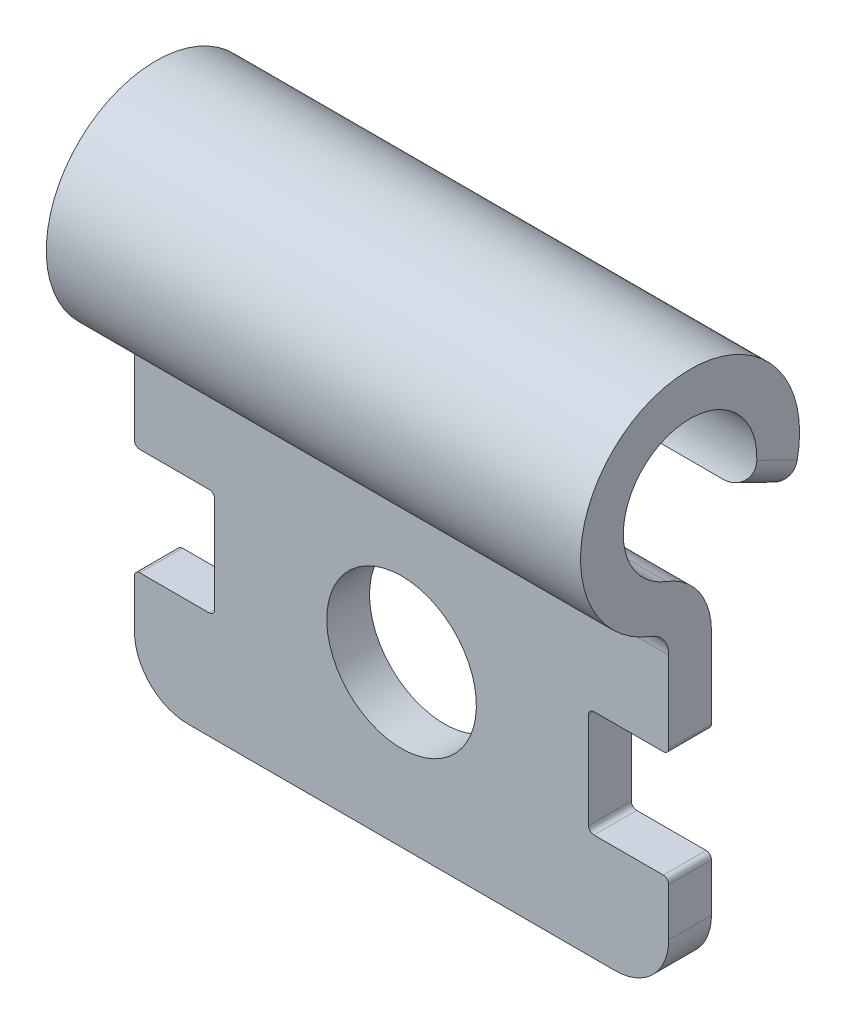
ISO-10303-21;
HEADER;
FILE_DESCRIPTION(('STEP AP214'),'2;1');
FILE_NAME('part.step','',(''),(''),'','','');
FILE_SCHEMA(('AUTOMOTIVE_DESIGN { 1 0 10303 214 1 1 1 1 }'));
ENDSEC;
DATA;
#1=APPLICATION_CONTEXT('core data for automotive mechanical design processes');
#2=APPLICATION_PROTOCOL_DEFINITION('international standard','automotive_design',2000,#1);
#3=PRODUCT_CONTEXT('',#1,'mechanical');
#4=PRODUCT('Part','Part','',(#3));
#5=PRODUCT_RELATED_PRODUCT_CATEGORY('part','',(#4));
#6=PRODUCT_DEFINITION_FORMATION('','',#4);
#7=PRODUCT_DEFINITION_CONTEXT('part definition',#1,'design');
#8=PRODUCT_DEFINITION('design','',#6,#7);
#9=PRODUCT_DEFINITION_SHAPE('','',#8);
#10=(LENGTH_UNIT() NAMED_UNIT(*) SI_UNIT(.MILLI.,.METRE.));
#11=(NAMED_UNIT(*) PLANE_ANGLE_UNIT() SI_UNIT($,.RADIAN.));
#12=(NAMED_UNIT(*) SI_UNIT($,.STERADIAN.) SOLID_ANGLE_UNIT());
#13=UNCERTAINTY_MEASURE_WITH_UNIT(LENGTH_MEASURE(1.E-05),#10,'distance_accuracy_value','');
#14=(GEOMETRIC_REPRESENTATION_CONTEXT(3) GLOBAL_UNCERTAINTY_ASSIGNED_CONTEXT((#13)) GLOBAL_UNIT_ASSIGNED_CONTEXT((#10,
#11,#12)) REPRESENTATION_CONTEXT('',''));
#15=CARTESIAN_POINT('',(0.,0.,0.));
#16=DIRECTION('',(0.,0.,1.));
#17=DIRECTION('',(1.,0.,0.));
#18=AXIS2_PLACEMENT_3D('',#15,#16,#17);
#19=CARTESIAN_POINT('',(10.,-2.38589605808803,0.9));
#20=DIRECTION('',(1.,0.,0.));
#21=DIRECTION('',(0.,0.,-1.));
#22=AXIS2_PLACEMENT_3D('',#19,#20,#21);
#23=PLANE('',#22);
#24=DIRECTION('',(0.,-1.,0.));
#25=VECTOR('',#24,1.);
#26=CARTESIAN_POINT('',(10.,-2.38589605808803,-0.4));
#27=LINE('',#26,#25);
#28=CARTESIAN_POINT('',(10.,-6.1,-0.400000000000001));
#29=VERTEX_POINT('',#28);
#30=CARTESIAN_POINT('',(10.,-7.,-0.400000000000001));
#31=VERTEX_POINT('',#30);
#32=EDGE_CURVE('E242',#29,#31,#27,.T.);
#33=ORIENTED_EDGE('',*,*,#32,.F.);
#34=DIRECTION('',(0.,0.,-1.));
#35=VECTOR('',#34,1.);
#36=CARTESIAN_POINT('',(10.,-6.1,0.4));
#37=LINE('',#36,#35);
#38=CARTESIAN_POINT('',(10.,-6.1,0.399999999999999));
#39=VERTEX_POINT('',#38);
#40=EDGE_CURVE('E456',#29,#39,#37,.F.);
#41=ORIENTED_EDGE('',*,*,#40,.T.);
#42=DIRECTION('',(0.,-1.,0.));
#43=VECTOR('',#42,1.);
#44=CARTESIAN_POINT('',(10.,-2.38589605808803,0.4));
#45=LINE('',#44,#43);
#46=CARTESIAN_POINT('',(10.,-7.,0.399999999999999));
#47=VERTEX_POINT('',#46);
#48=EDGE_CURVE('E271',#39,#47,#45,.T.);
#49=ORIENTED_EDGE('',*,*,#48,.T.);
#50=DIRECTION('',(0.,0.,1.));
#51=VECTOR('',#50,1.);
#52=CARTESIAN_POINT('',(10.,-7.,0.9));
#53=LINE('',#52,#51);
#54=EDGE_CURVE('E531',#47,#31,#53,.F.);
#55=ORIENTED_EDGE('',*,*,#54,.T.);
#56=EDGE_LOOP('',(#33,#41,#49,#55));
#57=FACE_BOUND('',#56,.T.);
#58=ADVANCED_FACE('F34',(#57),#23,.T.);
#59=CARTESIAN_POINT('',(0.,-2.38589605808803,0.9));
#60=DIRECTION('',(1.,0.,0.));
#61=DIRECTION('',(0.,0.,-1.));
#62=AXIS2_PLACEMENT_3D('',#59,#60,#61);
#63=PLANE('',#62);
#64=DIRECTION('',(0.,-1.,0.));
#65=VECTOR('',#64,1.);
#66=CARTESIAN_POINT('',(0.,-2.38589605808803,-0.4));
#67=LINE('',#66,#65);
#68=CARTESIAN_POINT('',(0.,-2.38589605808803,-0.4));
#69=VERTEX_POINT('',#68);
#70=CARTESIAN_POINT('',(0.,-3.9,-0.4));
#71=VERTEX_POINT('',#70);
#72=EDGE_CURVE('E226',#69,#71,#67,.T.);
#73=ORIENTED_EDGE('',*,*,#72,.T.);
#74=DIRECTION('',(0.,0.,1.));
#75=VECTOR('',#74,1.);
#76=CARTESIAN_POINT('',(0.,-3.9,0.9));
#77=LINE('',#76,#75);
#78=CARTESIAN_POINT('',(0.,-3.9,0.4));
#79=VERTEX_POINT('',#78);
#80=EDGE_CURVE('E388',#71,#79,#77,.T.);
#81=ORIENTED_EDGE('',*,*,#80,.T.);
#82=DIRECTION('',(0.,-1.,0.));
#83=VECTOR('',#82,1.);
#84=CARTESIAN_POINT('',(0.,-2.38589605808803,0.4));
#85=LINE('',#84,#83);
#86=CARTESIAN_POINT('',(0.,-2.38589605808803,0.4));
#87=VERTEX_POINT('',#86);
#88=EDGE_CURVE('E257',#87,#79,#85,.T.);
#89=ORIENTED_EDGE('',*,*,#88,.F.);
#90=CARTESIAN_POINT('',(0.,-2.38589605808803,0.9));
#91=DIRECTION('',(-1.,0.,0.));
#92=DIRECTION('',(0.,0.,-1.));
#93=AXIS2_PLACEMENT_3D('',#90,#91,#92);
#94=CIRCLE('',#93,0.5);
#95=CARTESIAN_POINT('',(0.,-1.91807330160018,0.723529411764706));
#96=VERTEX_POINT('',#95);
#97=EDGE_CURVE('E269',#96,#87,#94,.T.);
#98=ORIENTED_EDGE('',*,*,#97,.F.);
#99=CARTESIAN_POINT('',(0.,0.,0.));
#100=DIRECTION('',(1.,0.,0.));
#101=DIRECTION('',(0.,0.,-1.));
#102=AXIS2_PLACEMENT_3D('',#99,#100,#101);
#103=CIRCLE('',#102,2.05);
#104=CARTESIAN_POINT('',(0.,-0.422055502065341,-2.00608303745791));
#105=VERTEX_POINT('',#104);
#106=EDGE_CURVE('E267',#105,#96,#103,.T.);
#107=ORIENTED_EDGE('',*,*,#106,.F.);
#108=DIRECTION('',(0.,0.43834042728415,0.898809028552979));
#109=VECTOR('',#108,1.);
#110=CARTESIAN_POINT('',(0.,-0.098521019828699,-1.3426814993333));
#111=LINE('',#110,#109);
#112=CARTESIAN_POINT('',(0.,-0.0527775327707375,-1.24888531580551));
#113=VERTEX_POINT('',#112);
#114=EDGE_CURVE('E295',#105,#113,#111,.T.);
#115=ORIENTED_EDGE('',*,*,#114,.T.);
#116=CARTESIAN_POINT('',(0.,0.,0.));
#117=DIRECTION('',(1.,0.,0.));
#118=DIRECTION('',(0.,0.,-1.));
#119=AXIS2_PLACEMENT_3D('',#116,#117,#118);
#120=CIRCLE('',#119,1.25);
#121=CARTESIAN_POINT('',(0.,-1.16955689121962,0.441176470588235));
#122=VERTEX_POINT('',#121);
#123=EDGE_CURVE('E265',#113,#122,#120,.T.);
#124=ORIENTED_EDGE('',*,*,#123,.T.);
#125=CARTESIAN_POINT('',(0.,-2.38589605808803,0.9));
#126=DIRECTION('',(1.,0.,0.));
#127=DIRECTION('',(0.,0.,-1.));
#128=AXIS2_PLACEMENT_3D('',#125,#126,#127);
#129=CIRCLE('',#128,1.3);
#130=EDGE_CURVE('E263',#122,#69,#129,.F.);
#131=ORIENTED_EDGE('',*,*,#130,.T.);
#132=EDGE_LOOP('',(#73,#81,#89,#98,#107,#115,#124,#131));
#133=FACE_BOUND('',#132,.T.);
#134=ADVANCED_FACE('F356',(#133),#63,.F.);
#135=CARTESIAN_POINT('',(10.,-2.38589605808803,0.4));
#136=DIRECTION('',(0.,0.,-1.));
#137=DIRECTION('',(0.,1.,0.));
#138=AXIS2_PLACEMENT_3D('',#135,#136,#137);
#139=PLANE('',#138);
#140=CARTESIAN_POINT('',(5.,-5.,0.4));
#141=DIRECTION('',(0.,0.,-1.));
#142=DIRECTION('',(0.,1.,0.));
#143=AXIS2_PLACEMENT_3D('',#140,#141,#142);
#144=CIRCLE('',#143,1.4);
#145=CARTESIAN_POINT('',(5.,-3.6,0.4));
#146=VERTEX_POINT('',#145);
#147=EDGE_CURVE('E568',#146,#146,#144,.T.);
#148=ORIENTED_EDGE('',*,*,#147,.T.);
#149=EDGE_LOOP('',(#148));
#150=FACE_BOUND('',#149,.T.);
#151=ORIENTED_EDGE('',*,*,#48,.F.);
#152=CARTESIAN_POINT('',(9.9,-6.1,0.399999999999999));
#153=DIRECTION('',(0.,0.,-1.));
#154=DIRECTION('',(0.,1.,0.));
#155=AXIS2_PLACEMENT_3D('',#152,#153,#154);
#156=CIRCLE('',#155,0.1);
#157=CARTESIAN_POINT('',(9.9,-6.,0.4));
#158=VERTEX_POINT('',#157);
#159=EDGE_CURVE('E463',#39,#158,#156,.F.);
#160=ORIENTED_EDGE('',*,*,#159,.T.);
#161=DIRECTION('',(1.,0.,0.));
#162=VECTOR('',#161,1.);
#163=CARTESIAN_POINT('',(10.,-6.,0.4));
#164=LINE('',#163,#162);
#165=CARTESIAN_POINT('',(8.6,-6.,0.4));
#166=VERTEX_POINT('',#165);
#167=EDGE_CURVE('E546',#166,#158,#164,.T.);
#168=ORIENTED_EDGE('',*,*,#167,.F.);
#169=CARTESIAN_POINT('',(8.6,-5.9,0.399999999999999));
#170=DIRECTION('',(0.,0.,-1.));
#171=DIRECTION('',(0.,1.,0.));
#172=AXIS2_PLACEMENT_3D('',#169,#170,#171);
#173=CIRCLE('',#172,0.1);
#174=CARTESIAN_POINT('',(8.5,-5.9,0.4));
#175=VERTEX_POINT('',#174);
#176=EDGE_CURVE('E391',#166,#175,#173,.T.);
#177=ORIENTED_EDGE('',*,*,#176,.T.);
#178=DIRECTION('',(0.,-1.,0.));
#179=VECTOR('',#178,1.);
#180=CARTESIAN_POINT('',(8.5,-6.,0.4));
#181=LINE('',#180,#179);
#182=CARTESIAN_POINT('',(8.5,-4.1,0.4));
#183=VERTEX_POINT('',#182);
#184=EDGE_CURVE('E556',#183,#175,#181,.T.);
#185=ORIENTED_EDGE('',*,*,#184,.F.);
#186=CARTESIAN_POINT('',(8.6,-4.1,0.4));
#187=DIRECTION('',(0.,0.,-1.));
#188=DIRECTION('',(0.,1.,0.));
#189=AXIS2_PLACEMENT_3D('',#186,#187,#188);
#190=CIRCLE('',#189,0.1);
#191=CARTESIAN_POINT('',(8.6,-4.,0.4));
#192=VERTEX_POINT('',#191);
#193=EDGE_CURVE('E402',#183,#192,#190,.T.);
#194=ORIENTED_EDGE('',*,*,#193,.T.);
#195=DIRECTION('',(-1.,0.,0.));
#196=VECTOR('',#195,1.);
#197=CARTESIAN_POINT('',(10.,-4.,0.4));
#198=LINE('',#197,#196);
#199=CARTESIAN_POINT('',(9.9,-4.,0.4));
#200=VERTEX_POINT('',#199);
#201=EDGE_CURVE('E553',#200,#192,#198,.T.);
#202=ORIENTED_EDGE('',*,*,#201,.F.);
#203=CARTESIAN_POINT('',(9.9,-3.9,0.4));
#204=DIRECTION('',(0.,0.,-1.));
#205=DIRECTION('',(0.,1.,0.));
#206=AXIS2_PLACEMENT_3D('',#203,#204,#205);
#207=CIRCLE('',#206,0.1);
#208=CARTESIAN_POINT('',(10.,-3.9,0.4));
#209=VERTEX_POINT('',#208);
#210=EDGE_CURVE('E461',#200,#209,#207,.F.);
#211=ORIENTED_EDGE('',*,*,#210,.T.);
#212=CARTESIAN_POINT('',(10.,-2.38589605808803,0.4));
#213=VERTEX_POINT('',#212);
#214=EDGE_CURVE('E385',#213,#209,#45,.T.);
#215=ORIENTED_EDGE('',*,*,#214,.F.);
#216=DIRECTION('',(-1.,0.,0.));
#217=VECTOR('',#216,1.);
#218=CARTESIAN_POINT('',(10.,-2.38589605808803,0.4));
#219=LINE('',#218,#217);
#220=EDGE_CURVE('E256',#213,#87,#219,.T.);
#221=ORIENTED_EDGE('',*,*,#220,.T.);
#222=ORIENTED_EDGE('',*,*,#88,.T.);
#223=CARTESIAN_POINT('',(0.1,-3.9,0.4));
#224=DIRECTION('',(0.,0.,-1.));
#225=DIRECTION('',(0.,1.,0.));
#226=AXIS2_PLACEMENT_3D('',#223,#224,#225);
#227=CIRCLE('',#226,0.1);
#228=CARTESIAN_POINT('',(0.1,-4.,0.4));
#229=VERTEX_POINT('',#228);
#230=EDGE_CURVE('E458',#79,#229,#227,.F.);
#231=ORIENTED_EDGE('',*,*,#230,.T.);
#232=DIRECTION('',(-1.,0.,0.));
#233=VECTOR('',#232,1.);
#234=CARTESIAN_POINT('',(0.,-4.,0.4));
#235=LINE('',#234,#233);
#236=CARTESIAN_POINT('',(1.4,-4.,0.4));
#237=VERTEX_POINT('',#236);
#238=EDGE_CURVE('E412',#237,#229,#235,.T.);
#239=ORIENTED_EDGE('',*,*,#238,.F.);
#240=CARTESIAN_POINT('',(1.4,-4.1,0.4));
#241=DIRECTION('',(0.,0.,-1.));
#242=DIRECTION('',(0.,1.,0.));
#243=AXIS2_PLACEMENT_3D('',#240,#241,#242);
#244=CIRCLE('',#243,0.1);
#245=CARTESIAN_POINT('',(1.5,-4.1,0.4));
#246=VERTEX_POINT('',#245);
#247=EDGE_CURVE('E42',#237,#246,#244,.T.);
#248=ORIENTED_EDGE('',*,*,#247,.T.);
#249=DIRECTION('',(0.,1.,0.));
#250=VECTOR('',#249,1.);
#251=CARTESIAN_POINT('',(1.5,-6.,0.4));
#252=LINE('',#251,#250);
#253=CARTESIAN_POINT('',(1.5,-5.9,0.4));
#254=VERTEX_POINT('',#253);
#255=EDGE_CURVE('E410',#254,#246,#252,.T.);
#256=ORIENTED_EDGE('',*,*,#255,.F.);
#257=CARTESIAN_POINT('',(1.4,-5.9,0.399999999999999));
#258=DIRECTION('',(0.,0.,-1.));
#259=DIRECTION('',(0.,1.,0.));
#260=AXIS2_PLACEMENT_3D('',#257,#258,#259);
#261=CIRCLE('',#260,0.1);
#262=CARTESIAN_POINT('',(1.4,-6.,0.4));
#263=VERTEX_POINT('',#262);
#264=EDGE_CURVE('E55',#254,#263,#261,.T.);
#265=ORIENTED_EDGE('',*,*,#264,.T.);
#266=DIRECTION('',(1.,0.,0.));
#267=VECTOR('',#266,1.);
#268=CARTESIAN_POINT('',(0.,-6.,0.4));
#269=LINE('',#268,#267);
#270=CARTESIAN_POINT('',(0.1,-6.,0.4));
#271=VERTEX_POINT('',#270);
#272=EDGE_CURVE('E423',#271,#263,#269,.T.);
#273=ORIENTED_EDGE('',*,*,#272,.F.);
#274=CARTESIAN_POINT('',(0.1,-6.1,0.399999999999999));
#275=DIRECTION('',(0.,0.,-1.));
#276=DIRECTION('',(0.,1.,0.));
#277=AXIS2_PLACEMENT_3D('',#274,#275,#276);
#278=CIRCLE('',#277,0.1);
#279=CARTESIAN_POINT('',(0.,-6.1,0.399999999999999));
#280=VERTEX_POINT('',#279);
#281=EDGE_CURVE('E49',#271,#280,#278,.F.);
#282=ORIENTED_EDGE('',*,*,#281,.T.);
#283=CARTESIAN_POINT('',(0.,-7.,0.399999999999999));
#284=VERTEX_POINT('',#283);
#285=EDGE_CURVE('E261',#280,#284,#85,.T.);
#286=ORIENTED_EDGE('',*,*,#285,.T.);
#287=CARTESIAN_POINT('',(1.,-7.,0.399999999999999));
#288=DIRECTION('',(0.,0.,-1.));
#289=DIRECTION('',(0.,1.,0.));
#290=AXIS2_PLACEMENT_3D('',#287,#288,#289);
#291=CIRCLE('',#290,1.);
#292=CARTESIAN_POINT('',(0.999999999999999,-8.,0.399999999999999));
#293=VERTEX_POINT('',#292);
#294=EDGE_CURVE('E577',#284,#293,#291,.F.);
#295=ORIENTED_EDGE('',*,*,#294,.T.);
#296=DIRECTION('',(-1.,0.,0.));
#297=VECTOR('',#296,1.);
#298=CARTESIAN_POINT('',(10.,-8.,0.399999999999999));
#299=LINE('',#298,#297);
#300=CARTESIAN_POINT('',(9.,-8.,0.399999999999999));
#301=VERTEX_POINT('',#300);
#302=EDGE_CURVE('E286',#301,#293,#299,.T.);
#303=ORIENTED_EDGE('',*,*,#302,.F.);
#304=CARTESIAN_POINT('',(9.,-7.,0.399999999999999));
#305=DIRECTION('',(0.,0.,-1.));
#306=DIRECTION('',(0.,1.,0.));
#307=AXIS2_PLACEMENT_3D('',#304,#305,#306);
#308=CIRCLE('',#307,1.);
#309=EDGE_CURVE('E535',#301,#47,#308,.F.);
#310=ORIENTED_EDGE('',*,*,#309,.T.);
#311=EDGE_LOOP('',(#151,#160,#168,#177,#185,#194,#202,#211,#215,#221,#222,#231,#239,#248,#256,
#265,#273,#282,#286,#295,#303,#310));
#312=FACE_BOUND('',#311,.T.);
#313=ADVANCED_FACE('F362',(#150,#312),#139,.F.);
#314=CARTESIAN_POINT('',(10.,-8.,-0.400000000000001));
#315=DIRECTION('',(0.,-1.,0.));
#316=DIRECTION('',(0.,0.,-1.));
#317=AXIS2_PLACEMENT_3D('',#314,#315,#316);
#318=PLANE('',#317);
#319=DIRECTION('',(-1.,0.,0.));
#320=VECTOR('',#319,1.);
#321=CARTESIAN_POINT('',(10.,-8.,-0.400000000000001));
#322=LINE('',#321,#320);
#323=CARTESIAN_POINT('',(9.,-8.,-0.400000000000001));
#324=VERTEX_POINT('',#323);
#325=CARTESIAN_POINT('',(0.999999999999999,-8.,-0.400000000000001));
#326=VERTEX_POINT('',#325);
#327=EDGE_CURVE('E231',#324,#326,#322,.T.);
#328=ORIENTED_EDGE('',*,*,#327,.F.);
#329=DIRECTION('',(0.,0.,1.));
#330=VECTOR('',#329,1.);
#331=CARTESIAN_POINT('',(9.,-8.,-0.400000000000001));
#332=LINE('',#331,#330);
#333=EDGE_CURVE('E578',#324,#301,#332,.T.);
#334=ORIENTED_EDGE('',*,*,#333,.T.);
#335=ORIENTED_EDGE('',*,*,#302,.T.);
#336=DIRECTION('',(0.,0.,1.));
#337=VECTOR('',#336,1.);
#338=CARTESIAN_POINT('',(1.,-8.,-0.400000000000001));
#339=LINE('',#338,#337);
#340=EDGE_CURVE('E527',#293,#326,#339,.F.);
#341=ORIENTED_EDGE('',*,*,#340,.T.);
#342=EDGE_LOOP('',(#328,#334,#335,#341));
#343=FACE_BOUND('',#342,.T.);
#344=ADVANCED_FACE('F581',(#343),#318,.T.);
#345=CARTESIAN_POINT('',(10.,-2.38589605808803,-0.4));
#346=DIRECTION('',(0.,0.,-1.));
#347=DIRECTION('',(0.,1.,0.));
#348=AXIS2_PLACEMENT_3D('',#345,#346,#347);
#349=PLANE('',#348);
#350=DIRECTION('',(-1.,0.,0.));
#351=VECTOR('',#350,1.);
#352=CARTESIAN_POINT('',(10.,-6.,-0.400000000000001));
#353=LINE('',#352,#351);
#354=CARTESIAN_POINT('',(9.9,-6.,-0.400000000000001));
#355=VERTEX_POINT('',#354);
#356=CARTESIAN_POINT('',(8.6,-6.,-0.400000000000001));
#357=VERTEX_POINT('',#356);
#358=EDGE_CURVE('E548',#355,#357,#353,.T.);
#359=ORIENTED_EDGE('',*,*,#358,.F.);
#360=CARTESIAN_POINT('',(9.9,-6.1,-0.400000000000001));
#361=DIRECTION('',(0.,0.,-1.));
#362=DIRECTION('',(0.,1.,0.));
#363=AXIS2_PLACEMENT_3D('',#360,#361,#362);
#364=CIRCLE('',#363,0.1);
#365=EDGE_CURVE('E454',#355,#29,#364,.T.);
#366=ORIENTED_EDGE('',*,*,#365,.T.);
#367=ORIENTED_EDGE('',*,*,#32,.T.);
#368=CARTESIAN_POINT('',(9.,-7.,-0.400000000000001));
#369=DIRECTION('',(0.,0.,-1.));
#370=DIRECTION('',(0.,1.,0.));
#371=AXIS2_PLACEMENT_3D('',#368,#369,#370);
#372=CIRCLE('',#371,1.);
#373=EDGE_CURVE('E530',#31,#324,#372,.T.);
#374=ORIENTED_EDGE('',*,*,#373,.T.);
#375=ORIENTED_EDGE('',*,*,#327,.T.);
#376=CARTESIAN_POINT('',(1.,-7.,-0.400000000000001));
#377=DIRECTION('',(0.,0.,-1.));
#378=DIRECTION('',(0.,1.,0.));
#379=AXIS2_PLACEMENT_3D('',#376,#377,#378);
#380=CIRCLE('',#379,1.);
#381=CARTESIAN_POINT('',(0.,-7.,-0.400000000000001));
#382=VERTEX_POINT('',#381);
#383=EDGE_CURVE('E525',#326,#382,#380,.T.);
#384=ORIENTED_EDGE('',*,*,#383,.T.);
#385=CARTESIAN_POINT('',(0.,-6.1,-0.400000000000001));
#386=VERTEX_POINT('',#385);
#387=EDGE_CURVE('E260',#386,#382,#67,.T.);
#388=ORIENTED_EDGE('',*,*,#387,.F.);
#389=CARTESIAN_POINT('',(0.1,-6.1,-0.400000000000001));
#390=DIRECTION('',(0.,0.,-1.));
#391=DIRECTION('',(0.,1.,0.));
#392=AXIS2_PLACEMENT_3D('',#389,#390,#391);
#393=CIRCLE('',#392,0.1);
#394=CARTESIAN_POINT('',(0.0999999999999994,-6.,-0.400000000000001));
#395=VERTEX_POINT('',#394);
#396=EDGE_CURVE('E443',#386,#395,#393,.T.);
#397=ORIENTED_EDGE('',*,*,#396,.T.);
#398=DIRECTION('',(-1.,0.,0.));
#399=VECTOR('',#398,1.);
#400=CARTESIAN_POINT('',(10.,-6.,-0.400000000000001));
#401=LINE('',#400,#399);
#402=CARTESIAN_POINT('',(1.4,-6.,-0.400000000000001));
#403=VERTEX_POINT('',#402);
#404=EDGE_CURVE('E441',#403,#395,#401,.T.);
#405=ORIENTED_EDGE('',*,*,#404,.F.);
#406=CARTESIAN_POINT('',(1.4,-5.9,-0.400000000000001));
#407=DIRECTION('',(0.,0.,-1.));
#408=DIRECTION('',(0.,1.,0.));
#409=AXIS2_PLACEMENT_3D('',#406,#407,#408);
#410=CIRCLE('',#409,0.1);
#411=CARTESIAN_POINT('',(1.5,-5.9,-0.400000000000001));
#412=VERTEX_POINT('',#411);
#413=EDGE_CURVE('E407',#403,#412,#410,.F.);
#414=ORIENTED_EDGE('',*,*,#413,.T.);
#415=DIRECTION('',(0.,-1.,0.));
#416=VECTOR('',#415,1.);
#417=CARTESIAN_POINT('',(1.5,-2.38589605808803,-0.4));
#418=LINE('',#417,#416);
#419=CARTESIAN_POINT('',(1.5,-4.1,-0.400000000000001));
#420=VERTEX_POINT('',#419);
#421=EDGE_CURVE('E289',#420,#412,#418,.T.);
#422=ORIENTED_EDGE('',*,*,#421,.F.);
#423=CARTESIAN_POINT('',(1.4,-4.1,-0.4));
#424=DIRECTION('',(0.,0.,-1.));
#425=DIRECTION('',(0.,1.,0.));
#426=AXIS2_PLACEMENT_3D('',#423,#424,#425);
#427=CIRCLE('',#426,0.1);
#428=CARTESIAN_POINT('',(1.4,-4.,-0.4));
#429=VERTEX_POINT('',#428);
#430=EDGE_CURVE('E11',#420,#429,#427,.F.);
#431=ORIENTED_EDGE('',*,*,#430,.T.);
#432=DIRECTION('',(1.,0.,0.));
#433=VECTOR('',#432,1.);
#434=CARTESIAN_POINT('',(10.,-4.,-0.4));
#435=LINE('',#434,#433);
#436=CARTESIAN_POINT('',(0.0999999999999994,-4.,-0.4));
#437=VERTEX_POINT('',#436);
#438=EDGE_CURVE('E438',#437,#429,#435,.T.);
#439=ORIENTED_EDGE('',*,*,#438,.F.);
#440=CARTESIAN_POINT('',(0.1,-3.9,-0.4));
#441=DIRECTION('',(0.,0.,-1.));
#442=DIRECTION('',(0.,1.,0.));
#443=AXIS2_PLACEMENT_3D('',#440,#441,#442);
#444=CIRCLE('',#443,0.1);
#445=EDGE_CURVE('E439',#437,#71,#444,.T.);
#446=ORIENTED_EDGE('',*,*,#445,.T.);
#447=ORIENTED_EDGE('',*,*,#72,.F.);
#448=DIRECTION('',(-1.,0.,0.));
#449=VECTOR('',#448,1.);
#450=CARTESIAN_POINT('',(10.,-2.38589605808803,-0.4));
#451=LINE('',#450,#449);
#452=CARTESIAN_POINT('',(10.,-2.38589605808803,-0.4));
#453=VERTEX_POINT('',#452);
#454=EDGE_CURVE('E218',#453,#69,#451,.T.);
#455=ORIENTED_EDGE('',*,*,#454,.F.);
#456=CARTESIAN_POINT('',(10.,-3.9,-0.4));
#457=VERTEX_POINT('',#456);
#458=EDGE_CURVE('E223',#453,#457,#27,.T.);
#459=ORIENTED_EDGE('',*,*,#458,.T.);
#460=CARTESIAN_POINT('',(9.9,-3.9,-0.4));
#461=DIRECTION('',(0.,0.,-1.));
#462=DIRECTION('',(0.,1.,0.));
#463=AXIS2_PLACEMENT_3D('',#460,#461,#462);
#464=CIRCLE('',#463,0.1);
#465=CARTESIAN_POINT('',(9.9,-4.,-0.4));
#466=VERTEX_POINT('',#465);
#467=EDGE_CURVE('E446',#457,#466,#464,.T.);
#468=ORIENTED_EDGE('',*,*,#467,.T.);
#469=DIRECTION('',(1.,0.,0.));
#470=VECTOR('',#469,1.);
#471=CARTESIAN_POINT('',(10.,-4.,-0.4));
#472=LINE('',#471,#470);
#473=CARTESIAN_POINT('',(8.6,-4.,-0.4));
#474=VERTEX_POINT('',#473);
#475=EDGE_CURVE('E560',#474,#466,#472,.T.);
#476=ORIENTED_EDGE('',*,*,#475,.F.);
#477=CARTESIAN_POINT('',(8.6,-4.1,-0.4));
#478=DIRECTION('',(0.,0.,-1.));
#479=DIRECTION('',(0.,1.,0.));
#480=AXIS2_PLACEMENT_3D('',#477,#478,#479);
#481=CIRCLE('',#480,0.1);
#482=CARTESIAN_POINT('',(8.5,-4.1,-0.400000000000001));
#483=VERTEX_POINT('',#482);
#484=EDGE_CURVE('E404',#474,#483,#481,.F.);
#485=ORIENTED_EDGE('',*,*,#484,.T.);
#486=DIRECTION('',(0.,1.,0.));
#487=VECTOR('',#486,1.);
#488=CARTESIAN_POINT('',(8.5,-2.38589605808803,-0.4));
#489=LINE('',#488,#487);
#490=CARTESIAN_POINT('',(8.5,-5.9,-0.400000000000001));
#491=VERTEX_POINT('',#490);
#492=EDGE_CURVE('E292',#491,#483,#489,.T.);
#493=ORIENTED_EDGE('',*,*,#492,.F.);
#494=CARTESIAN_POINT('',(8.6,-5.9,-0.400000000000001));
#495=DIRECTION('',(0.,0.,-1.));
#496=DIRECTION('',(0.,1.,0.));
#497=AXIS2_PLACEMENT_3D('',#494,#495,#496);
#498=CIRCLE('',#497,0.1);
#499=EDGE_CURVE('E394',#491,#357,#498,.F.);
#500=ORIENTED_EDGE('',*,*,#499,.T.);
#501=EDGE_LOOP('',(#359,#366,#367,#374,#375,#384,#388,#397,#405,#414,#422,#431,#439,#446,#447,
#455,#459,#468,#476,#485,#493,#500));
#502=FACE_BOUND('',#501,.T.);
#503=CARTESIAN_POINT('',(5.,-5.,-0.4));
#504=DIRECTION('',(0.,0.,-1.));
#505=DIRECTION('',(0.,1.,0.));
#506=AXIS2_PLACEMENT_3D('',#503,#504,#505);
#507=CIRCLE('',#506,1.4);
#508=CARTESIAN_POINT('',(5.,-3.6,-0.4));
#509=VERTEX_POINT('',#508);
#510=EDGE_CURVE('E440',#509,#509,#507,.T.);
#511=ORIENTED_EDGE('',*,*,#510,.F.);
#512=EDGE_LOOP('',(#511));
#513=FACE_BOUND('',#512,.T.);
#514=ADVANCED_FACE('F221',(#502,#513),#349,.T.);
#515=CARTESIAN_POINT('',(10.,-2.38589605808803,0.9));
#516=DIRECTION('',(-1.,0.,0.));
#517=DIRECTION('',(0.,0.,1.));
#518=AXIS2_PLACEMENT_3D('',#515,#516,#517);
#519=CYLINDRICAL_SURFACE('',#518,1.3);
#520=ORIENTED_EDGE('',*,*,#130,.F.);
#521=DIRECTION('',(-1.,0.,0.));
#522=VECTOR('',#521,1.);
#523=CARTESIAN_POINT('',(10.,-1.16955689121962,0.441176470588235));
#524=LINE('',#523,#522);
#525=CARTESIAN_POINT('',(10.,-1.16955689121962,0.441176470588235));
#526=VERTEX_POINT('',#525);
#527=EDGE_CURVE('E232',#526,#122,#524,.T.);
#528=ORIENTED_EDGE('',*,*,#527,.F.);
#529=CARTESIAN_POINT('',(10.,-2.38589605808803,0.9));
#530=DIRECTION('',(1.,0.,0.));
#531=DIRECTION('',(0.,0.,-1.));
#532=AXIS2_PLACEMENT_3D('',#529,#530,#531);
#533=CIRCLE('',#532,1.3);
#534=EDGE_CURVE('E239',#526,#453,#533,.F.);
#535=ORIENTED_EDGE('',*,*,#534,.T.);
#536=ORIENTED_EDGE('',*,*,#454,.T.);
#537=EDGE_LOOP('',(#520,#528,#535,#536));
#538=FACE_BOUND('',#537,.T.);
#539=ADVANCED_FACE('F245',(#538),#519,.T.);
#540=CARTESIAN_POINT('',(10.,0.,0.));
#541=DIRECTION('',(-1.,0.,0.));
#542=DIRECTION('',(0.,0.,1.));
#543=AXIS2_PLACEMENT_3D('',#540,#541,#542);
#544=CYLINDRICAL_SURFACE('',#543,1.25);
#545=ORIENTED_EDGE('',*,*,#123,.F.);
#546=CARTESIAN_POINT('',(0.,-0.0527775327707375,-1.24888531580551));
#547=CARTESIAN_POINT('',(-3.32202280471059E-05,-0.0806657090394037,-1.24774131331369));
#548=CARTESIAN_POINT('',(0.00196134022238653,-0.108545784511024,-1.24559402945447));
#549=CARTESIAN_POINT('',(0.0101514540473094,-0.16349995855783,-1.23956010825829));
#550=CARTESIAN_POINT('',(0.0163493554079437,-0.190573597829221,-1.23567249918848));
#551=CARTESIAN_POINT('',(0.0331156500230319,-0.243166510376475,-1.22641392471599));
#552=CARTESIAN_POINT('',(0.043696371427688,-0.268681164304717,-1.22103878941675));
#553=CARTESIAN_POINT('',(0.0690648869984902,-0.317248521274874,-1.20932875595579));
#554=CARTESIAN_POINT('',(0.0838483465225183,-0.340303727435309,-1.20299484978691));
#555=CARTESIAN_POINT('',(0.11659329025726,-0.382477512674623,-1.19024310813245));
#556=CARTESIAN_POINT('',(0.134406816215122,-0.401715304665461,-1.1838383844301));
#557=CARTESIAN_POINT('',(0.173104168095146,-0.436928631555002,-1.17129990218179));
#558=CARTESIAN_POINT('',(0.193989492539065,-0.452902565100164,-1.16516627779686));
#559=CARTESIAN_POINT('',(0.238554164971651,-0.481484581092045,-1.15365254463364));
#560=CARTESIAN_POINT('',(0.262267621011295,-0.49404398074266,-1.14828380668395));
#561=CARTESIAN_POINT('',(0.311604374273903,-0.515320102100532,-1.13889439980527));
#562=CARTESIAN_POINT('',(0.337227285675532,-0.524037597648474,-1.13487345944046));
#563=CARTESIAN_POINT('',(0.385637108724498,-0.536481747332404,-1.12903893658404));
#564=CARTESIAN_POINT('',(0.408252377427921,-0.540770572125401,-1.12698064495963));
#565=CARTESIAN_POINT('',(0.45390944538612,-0.546493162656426,-1.12420961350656));
#566=CARTESIAN_POINT('',(0.476951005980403,-0.54792847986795,-1.12349614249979));
#567=CARTESIAN_POINT('',(0.5,-0.547925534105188,-1.12351128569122));
#568=B_SPLINE_CURVE_WITH_KNOTS('',3,(#546,#547,#548,#549,#550,#551,#552,#553,#554,#555,#556,
#557,#558,#559,#560,#561,#562,#563,#564,#565,#566,#567),.UNSPECIFIED.,.F.,.F.,(4,2,2,2,2,2,2,2,
2,2,4),(0.,0.0836956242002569,0.167438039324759,0.251417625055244,0.335310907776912,
0.415902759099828,0.496534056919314,0.578260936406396,0.659971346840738,0.729086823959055,
0.798164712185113),.UNSPECIFIED.);
#569=CARTESIAN_POINT('',(0.5,-0.547925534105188,-1.12351128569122));
#570=VERTEX_POINT('',#569);
#571=EDGE_CURVE('E305',#113,#570,#568,.T.);
#572=ORIENTED_EDGE('',*,*,#571,.T.);
#573=DIRECTION('',(-1.,0.,0.));
#574=VECTOR('',#573,1.);
#575=CARTESIAN_POINT('',(10.,-0.547925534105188,-1.12351128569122));
#576=LINE('',#575,#574);
#577=CARTESIAN_POINT('',(9.5,-0.547925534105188,-1.12351128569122));
#578=VERTEX_POINT('',#577);
#579=EDGE_CURVE('E280',#578,#570,#576,.T.);
#580=ORIENTED_EDGE('',*,*,#579,.F.);
#581=CARTESIAN_POINT('',(9.5,-0.547925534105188,-1.12351128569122));
#582=CARTESIAN_POINT('',(9.52808434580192,-0.547935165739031,-1.12347665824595));
#583=CARTESIAN_POINT('',(9.55616203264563,-0.545799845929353,-1.12454745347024));
#584=CARTESIAN_POINT('',(9.61151194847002,-0.537308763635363,-1.12864488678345));
#585=CARTESIAN_POINT('',(9.63878457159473,-0.5309551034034,-1.13167055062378));
#586=CARTESIAN_POINT('',(9.69177678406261,-0.514091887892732,-1.13942539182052));
#587=CARTESIAN_POINT('',(9.71749548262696,-0.503579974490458,-1.14415553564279));
#588=CARTESIAN_POINT('',(9.76662245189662,-0.478551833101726,-1.1548479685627));
#589=CARTESIAN_POINT('',(9.79003109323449,-0.464036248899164,-1.16081005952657));
#590=CARTESIAN_POINT('',(9.8337089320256,-0.431355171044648,-1.17334379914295));
#591=CARTESIAN_POINT('',(9.85399788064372,-0.413214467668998,-1.17991115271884));
#592=CARTESIAN_POINT('',(9.8910169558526,-0.373614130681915,-1.19304075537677));
#593=CARTESIAN_POINT('',(9.9077486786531,-0.352155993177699,-1.19960300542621));
#594=CARTESIAN_POINT('',(9.93680332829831,-0.307091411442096,-1.21190965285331));
#595=CARTESIAN_POINT('',(9.94923251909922,-0.283558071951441,-1.2176712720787));
#596=CARTESIAN_POINT('',(9.97005326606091,-0.234519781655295,-1.22805875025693));
#597=CARTESIAN_POINT('',(9.97844293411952,-0.209013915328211,-1.23268407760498));
#598=CARTESIAN_POINT('',(9.98994499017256,-0.1617349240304,-1.23967720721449));
#599=CARTESIAN_POINT('',(9.99375406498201,-0.140164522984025,-1.24230621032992));
#600=CARTESIAN_POINT('',(9.99878377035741,-0.0966600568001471,-1.24645132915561));
#601=CARTESIAN_POINT('',(10.0000094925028,-0.0747267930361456,-1.24796963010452));
#602=CARTESIAN_POINT('',(10.,-0.0527775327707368,-1.24888531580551));
#603=B_SPLINE_CURVE_WITH_KNOTS('',3,(#581,#582,#583,#584,#585,#586,#587,#588,#589,#590,#591,
#592,#593,#594,#595,#596,#597,#598,#599,#600,#601,#602),.UNSPECIFIED.,.F.,.F.,(4,2,2,2,2,2,2,2,
2,2,4),(0.,0.0841422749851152,0.168242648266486,0.252390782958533,0.336525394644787,
0.420103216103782,0.50364345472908,0.58494182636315,0.666278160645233,0.732281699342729,
0.798155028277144),.UNSPECIFIED.);
#604=CARTESIAN_POINT('',(10.,-0.0527775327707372,-1.24888531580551));
#605=VERTEX_POINT('',#604);
#606=EDGE_CURVE('E298',#578,#605,#603,.T.);
#607=ORIENTED_EDGE('',*,*,#606,.T.);
#608=CARTESIAN_POINT('',(10.,0.,0.));
#609=DIRECTION('',(1.,0.,0.));
#610=DIRECTION('',(0.,0.,-1.));
#611=AXIS2_PLACEMENT_3D('',#608,#609,#610);
#612=CIRCLE('',#611,1.25);
#613=EDGE_CURVE('E247',#605,#526,#612,.T.);
#614=ORIENTED_EDGE('',*,*,#613,.T.);
#615=ORIENTED_EDGE('',*,*,#527,.T.);
#616=EDGE_LOOP('',(#545,#572,#580,#607,#614,#615));
#617=FACE_BOUND('',#616,.T.);
#618=ADVANCED_FACE('F311',(#617),#544,.F.);
#619=CARTESIAN_POINT('',(10.,-0.898597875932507,-1.84255850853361));
#620=DIRECTION('',(0.,-0.898809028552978,0.43834042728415));
#621=DIRECTION('',(0.,-0.43834042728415,-0.898809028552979));
#622=AXIS2_PLACEMENT_3D('',#619,#620,#621);
#623=PLANE('',#622);
#624=ORIENTED_EDGE('',*,*,#579,.T.);
#625=DIRECTION('',(0.,0.43834042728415,0.898809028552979));
#626=VECTOR('',#625,1.);
#627=CARTESIAN_POINT('',(0.5,-0.898597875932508,-1.84255850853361));
#628=LINE('',#627,#626);
#629=CARTESIAN_POINT('',(0.5,-0.898597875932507,-1.84255850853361));
#630=VERTEX_POINT('',#629);
#631=EDGE_CURVE('E335',#570,#630,#628,.F.);
#632=ORIENTED_EDGE('',*,*,#631,.T.);
#633=DIRECTION('',(-1.,0.,0.));
#634=VECTOR('',#633,1.);
#635=CARTESIAN_POINT('',(10.,-0.898597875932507,-1.84255850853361));
#636=LINE('',#635,#634);
#637=CARTESIAN_POINT('',(9.5,-0.898597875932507,-1.84255850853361));
#638=VERTEX_POINT('',#637);
#639=EDGE_CURVE('E277',#638,#630,#636,.T.);
#640=ORIENTED_EDGE('',*,*,#639,.F.);
#641=DIRECTION('',(0.,0.43834042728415,0.898809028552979));
#642=VECTOR('',#641,1.);
#643=CARTESIAN_POINT('',(9.5,-0.898597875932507,-1.84255850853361));
#644=LINE('',#643,#642);
#645=EDGE_CURVE('E596',#638,#578,#644,.T.);
#646=ORIENTED_EDGE('',*,*,#645,.T.);
#647=EDGE_LOOP('',(#624,#632,#640,#646));
#648=FACE_BOUND('',#647,.T.);
#649=ADVANCED_FACE('F345',(#648),#623,.T.);
#650=CARTESIAN_POINT('',(10.,0.,0.));
#651=DIRECTION('',(-1.,0.,0.));
#652=DIRECTION('',(0.,0.,1.));
#653=AXIS2_PLACEMENT_3D('',#650,#651,#652);
#654=CYLINDRICAL_SURFACE('',#653,2.05);
#655=ORIENTED_EDGE('',*,*,#639,.T.);
#656=CARTESIAN_POINT('',(0.5,-0.898597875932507,-1.84255850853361));
#657=CARTESIAN_POINT('',(0.471887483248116,-0.898612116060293,-1.84253325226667));
#658=CARTESIAN_POINT('',(0.443781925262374,-0.896468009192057,-1.84359691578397));
#659=CARTESIAN_POINT('',(0.388383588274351,-0.887967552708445,-1.8477158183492));
#660=CARTESIAN_POINT('',(0.361090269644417,-0.881614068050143,-1.85076970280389));
#661=CARTESIAN_POINT('',(0.308061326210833,-0.864794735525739,-1.85868528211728));
#662=CARTESIAN_POINT('',(0.282326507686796,-0.854326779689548,-1.86354790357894));
#663=CARTESIAN_POINT('',(0.233166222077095,-0.829488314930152,-1.87473602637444));
#664=CARTESIAN_POINT('',(0.209740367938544,-0.815118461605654,-1.88106128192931));
#665=CARTESIAN_POINT('',(0.165921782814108,-0.782814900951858,-1.89473121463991));
#666=CARTESIAN_POINT('',(0.145521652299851,-0.76489014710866,-1.90207331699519));
#667=CARTESIAN_POINT('',(0.108272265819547,-0.725863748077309,-1.9173052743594));
#668=CARTESIAN_POINT('',(0.0914228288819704,-0.704762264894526,-1.92519510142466));
#669=CARTESIAN_POINT('',(0.0618992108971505,-0.660144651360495,-1.94094369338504));
#670=CARTESIAN_POINT('',(0.0491843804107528,-0.636655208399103,-1.94880196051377));
#671=CARTESIAN_POINT('',(0.028014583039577,-0.587706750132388,-1.96411738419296));
#672=CARTESIAN_POINT('',(0.0195588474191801,-0.562248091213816,-1.97157461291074));
#673=CARTESIAN_POINT('',(0.00885849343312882,-0.517597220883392,-1.98367433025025));
#674=CARTESIAN_POINT('',(0.00552696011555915,-0.498708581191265,-1.98850951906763));
#675=CARTESIAN_POINT('',(0.00109737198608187,-0.460586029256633,-1.99768588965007));
#676=CARTESIAN_POINT('',(-4.36288039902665E-06,-0.441352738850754,-2.00202787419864));
#677=CARTESIAN_POINT('',(0.,-0.422055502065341,-2.00608303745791));
#678=B_SPLINE_CURVE_WITH_KNOTS('',3,(#656,#657,#658,#659,#660,#661,#662,#663,#664,#665,#666,
#667,#668,#669,#670,#671,#672,#673,#674,#675,#676,#677),.UNSPECIFIED.,.F.,.F.,(4,2,2,2,2,2,2,2,
2,2,4),(0.,0.0842259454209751,0.168394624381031,0.252606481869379,0.336804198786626,
0.420792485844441,0.504776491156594,0.587907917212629,0.671024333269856,0.730236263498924,
0.789350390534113),.UNSPECIFIED.);
#679=EDGE_CURVE('E334',#630,#105,#678,.T.);
#680=ORIENTED_EDGE('',*,*,#679,.T.);
#681=ORIENTED_EDGE('',*,*,#106,.T.);
#682=DIRECTION('',(-1.,0.,0.));
#683=VECTOR('',#682,1.);
#684=CARTESIAN_POINT('',(10.,-1.91807330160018,0.723529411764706));
#685=LINE('',#684,#683);
#686=CARTESIAN_POINT('',(10.,-1.91807330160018,0.723529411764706));
#687=VERTEX_POINT('',#686);
#688=EDGE_CURVE('E274',#687,#96,#685,.T.);
#689=ORIENTED_EDGE('',*,*,#688,.F.);
#690=CARTESIAN_POINT('',(10.,0.,0.));
#691=DIRECTION('',(1.,0.,0.));
#692=DIRECTION('',(0.,0.,-1.));
#693=AXIS2_PLACEMENT_3D('',#690,#691,#692);
#694=CIRCLE('',#693,2.05);
#695=CARTESIAN_POINT('',(10.,-0.42205550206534,-2.00608303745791));
#696=VERTEX_POINT('',#695);
#697=EDGE_CURVE('E249',#696,#687,#694,.T.);
#698=ORIENTED_EDGE('',*,*,#697,.F.);
#699=CARTESIAN_POINT('',(10.,-0.42205550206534,-2.00608303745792));
#700=CARTESIAN_POINT('',(10.000028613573,-0.449504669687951,-2.00033047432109));
#701=CARTESIAN_POINT('',(9.99778232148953,-0.476836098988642,-1.99397042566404));
#702=CARTESIAN_POINT('',(9.98879367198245,-0.530508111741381,-1.98035438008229));
#703=CARTESIAN_POINT('',(9.98205273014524,-0.556849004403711,-1.97309866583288));
#704=CARTESIAN_POINT('',(9.96411591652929,-0.607838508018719,-1.95799571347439));
#705=CARTESIAN_POINT('',(9.95291381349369,-0.632484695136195,-1.95014766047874));
#706=CARTESIAN_POINT('',(9.92633298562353,-0.679347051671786,-1.93432109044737));
#707=CARTESIAN_POINT('',(9.91095628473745,-0.701564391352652,-1.92634263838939));
#708=CARTESIAN_POINT('',(9.87670967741,-0.742685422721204,-1.9108624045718));
#709=CARTESIAN_POINT('',(9.85789663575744,-0.761634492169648,-1.90335520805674));
#710=CARTESIAN_POINT('',(9.81714517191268,-0.796195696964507,-1.88915914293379));
#711=CARTESIAN_POINT('',(9.79520578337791,-0.811806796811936,-1.88247052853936));
#712=CARTESIAN_POINT('',(9.74867359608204,-0.83944423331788,-1.87031111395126));
#713=CARTESIAN_POINT('',(9.72406484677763,-0.851447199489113,-1.86484830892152));
#714=CARTESIAN_POINT('',(9.67300123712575,-0.87149616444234,-1.85556378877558));
#715=CARTESIAN_POINT('',(9.64654719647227,-0.879543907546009,-1.85174135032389));
#716=CARTESIAN_POINT('',(9.59999897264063,-0.889882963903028,-1.84678964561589));
#717=CARTESIAN_POINT('',(9.58016234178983,-0.893149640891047,-1.84520840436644));
#718=CARTESIAN_POINT('',(9.54021967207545,-0.897506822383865,-1.84309058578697));
#719=CARTESIAN_POINT('',(9.52011396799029,-0.898599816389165,-1.8425528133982));
#720=CARTESIAN_POINT('',(9.5,-0.898597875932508,-1.84255850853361));
#721=B_SPLINE_CURVE_WITH_KNOTS('',3,(#699,#700,#701,#702,#703,#704,#705,#706,#707,#708,#709,
#710,#711,#712,#713,#714,#715,#716,#717,#718,#719,#720),.UNSPECIFIED.,.F.,.F.,(4,2,2,2,2,2,2,2,
2,2,4),(0.,0.0840538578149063,0.168081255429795,0.252226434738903,0.336330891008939,
0.419152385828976,0.501999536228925,0.585372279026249,0.668708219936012,0.729066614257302,
0.789355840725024),.UNSPECIFIED.);
#722=EDGE_CURVE('E327',#696,#638,#721,.T.);
#723=ORIENTED_EDGE('',*,*,#722,.T.);
#724=EDGE_LOOP('',(#655,#680,#681,#689,#698,#723));
#725=FACE_BOUND('',#724,.T.);
#726=ADVANCED_FACE('F340',(#725),#654,.T.);
#727=CARTESIAN_POINT('',(10.,-2.38589605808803,0.9));
#728=DIRECTION('',(-1.,0.,0.));
#729=DIRECTION('',(0.,0.,1.));
#730=AXIS2_PLACEMENT_3D('',#727,#728,#729);
#731=CYLINDRICAL_SURFACE('',#730,0.5);
#732=ORIENTED_EDGE('',*,*,#97,.T.);
#733=ORIENTED_EDGE('',*,*,#220,.F.);
#734=CARTESIAN_POINT('',(10.,-2.38589605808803,0.9));
#735=DIRECTION('',(-1.,0.,0.));
#736=DIRECTION('',(0.,0.,-1.));
#737=AXIS2_PLACEMENT_3D('',#734,#735,#736);
#738=CIRCLE('',#737,0.5);
#739=EDGE_CURVE('E254',#687,#213,#738,.T.);
#740=ORIENTED_EDGE('',*,*,#739,.F.);
#741=ORIENTED_EDGE('',*,*,#688,.T.);
#742=EDGE_LOOP('',(#732,#733,#740,#741));
#743=FACE_BOUND('',#742,.T.);
#744=ADVANCED_FACE('F344',(#743),#731,.F.);
#745=ORIENTED_EDGE('',*,*,#214,.T.);
#746=DIRECTION('',(0.,0.,1.));
#747=VECTOR('',#746,1.);
#748=CARTESIAN_POINT('',(10.,-3.9,-0.4));
#749=LINE('',#748,#747);
#750=EDGE_CURVE('E241',#209,#457,#749,.F.);
#751=ORIENTED_EDGE('',*,*,#750,.T.);
#752=ORIENTED_EDGE('',*,*,#458,.F.);
#753=ORIENTED_EDGE('',*,*,#534,.F.);
#754=ORIENTED_EDGE('',*,*,#613,.F.);
#755=DIRECTION('',(0.,0.43834042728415,0.898809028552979));
#756=VECTOR('',#755,1.);
#757=CARTESIAN_POINT('',(10.,0.345558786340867,-0.432103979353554));
#758=LINE('',#757,#756);
#759=EDGE_CURVE('E582',#605,#696,#758,.F.);
#760=ORIENTED_EDGE('',*,*,#759,.T.);
#761=ORIENTED_EDGE('',*,*,#697,.T.);
#762=ORIENTED_EDGE('',*,*,#739,.T.);
#763=EDGE_LOOP('',(#745,#751,#752,#753,#754,#760,#761,#762));
#764=FACE_BOUND('',#763,.T.);
#765=ADVANCED_FACE('F237',(#764),#23,.T.);
#766=ORIENTED_EDGE('',*,*,#285,.F.);
#767=DIRECTION('',(0.,0.,-1.));
#768=VECTOR('',#767,1.);
#769=CARTESIAN_POINT('',(0.,-6.1,0.9));
#770=LINE('',#769,#768);
#771=EDGE_CURVE('E476',#280,#386,#770,.T.);
#772=ORIENTED_EDGE('',*,*,#771,.T.);
#773=ORIENTED_EDGE('',*,*,#387,.T.);
#774=DIRECTION('',(0.,0.,1.));
#775=VECTOR('',#774,1.);
#776=CARTESIAN_POINT('',(0.,-7.,0.399999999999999));
#777=LINE('',#776,#775);
#778=EDGE_CURVE('E529',#382,#284,#777,.T.);
#779=ORIENTED_EDGE('',*,*,#778,.T.);
#780=EDGE_LOOP('',(#766,#772,#773,#779));
#781=FACE_BOUND('',#780,.T.);
#782=ADVANCED_FACE('F364',(#781),#63,.F.);
#783=CARTESIAN_POINT('',(5.,-5.,2.05));
#784=DIRECTION('',(0.,0.,-1.));
#785=DIRECTION('',(0.,1.,0.));
#786=AXIS2_PLACEMENT_3D('',#783,#784,#785);
#787=CYLINDRICAL_SURFACE('',#786,1.4);
#788=ORIENTED_EDGE('',*,*,#510,.T.);
#789=EDGE_LOOP('',(#788));
#790=FACE_BOUND('',#789,.T.);
#791=ORIENTED_EDGE('',*,*,#147,.F.);
#792=EDGE_LOOP('',(#791));
#793=FACE_BOUND('',#792,.T.);
#794=ADVANCED_FACE('F372',(#790,#793),#787,.F.);
#795=CARTESIAN_POINT('',(0.,-4.,-2.05));
#796=DIRECTION('',(0.,1.,0.));
#797=DIRECTION('',(0.,0.,1.));
#798=AXIS2_PLACEMENT_3D('',#795,#796,#797);
#799=PLANE('',#798);
#800=ORIENTED_EDGE('',*,*,#438,.T.);
#801=DIRECTION('',(0.,0.,1.));
#802=VECTOR('',#801,1.);
#803=CARTESIAN_POINT('',(1.4,-4.,0.4));
#804=LINE('',#803,#802);
#805=EDGE_CURVE('E392',#429,#237,#804,.T.);
#806=ORIENTED_EDGE('',*,*,#805,.T.);
#807=ORIENTED_EDGE('',*,*,#238,.T.);
#808=DIRECTION('',(0.,0.,1.));
#809=VECTOR('',#808,1.);
#810=CARTESIAN_POINT('',(0.1,-4.,-2.05));
#811=LINE('',#810,#809);
#812=EDGE_CURVE('E397',#229,#437,#811,.F.);
#813=ORIENTED_EDGE('',*,*,#812,.T.);
#814=EDGE_LOOP('',(#800,#806,#807,#813));
#815=FACE_BOUND('',#814,.T.);
#816=ADVANCED_FACE('F437',(#815),#799,.F.);
#817=CARTESIAN_POINT('',(1.5,-6.,-2.05));
#818=DIRECTION('',(1.,0.,0.));
#819=DIRECTION('',(0.,1.,0.));
#820=AXIS2_PLACEMENT_3D('',#817,#818,#819);
#821=PLANE('',#820);
#822=ORIENTED_EDGE('',*,*,#421,.T.);
#823=DIRECTION('',(0.,0.,1.));
#824=VECTOR('',#823,1.);
#825=CARTESIAN_POINT('',(1.5,-5.9,0.4));
#826=LINE('',#825,#824);
#827=EDGE_CURVE('E422',#412,#254,#826,.T.);
#828=ORIENTED_EDGE('',*,*,#827,.T.);
#829=ORIENTED_EDGE('',*,*,#255,.T.);
#830=DIRECTION('',(0.,0.,1.));
#831=VECTOR('',#830,1.);
#832=CARTESIAN_POINT('',(1.5,-4.1,-0.400000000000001));
#833=LINE('',#832,#831);
#834=EDGE_CURVE('E419',#246,#420,#833,.F.);
#835=ORIENTED_EDGE('',*,*,#834,.T.);
#836=EDGE_LOOP('',(#822,#828,#829,#835));
#837=FACE_BOUND('',#836,.T.);
#838=ADVANCED_FACE('F418',(#837),#821,.F.);
#839=CARTESIAN_POINT('',(0.,-6.,-2.05));
#840=DIRECTION('',(0.,-1.,0.));
#841=DIRECTION('',(0.,0.,-1.));
#842=AXIS2_PLACEMENT_3D('',#839,#840,#841);
#843=PLANE('',#842);
#844=ORIENTED_EDGE('',*,*,#404,.T.);
#845=DIRECTION('',(0.,0.,-1.));
#846=VECTOR('',#845,1.);
#847=CARTESIAN_POINT('',(0.1,-6.,-2.05));
#848=LINE('',#847,#846);
#849=EDGE_CURVE('E427',#395,#271,#848,.F.);
#850=ORIENTED_EDGE('',*,*,#849,.T.);
#851=ORIENTED_EDGE('',*,*,#272,.T.);
#852=DIRECTION('',(0.,0.,1.));
#853=VECTOR('',#852,1.);
#854=CARTESIAN_POINT('',(1.4,-6.,-0.400000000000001));
#855=LINE('',#854,#853);
#856=EDGE_CURVE('E430',#263,#403,#855,.F.);
#857=ORIENTED_EDGE('',*,*,#856,.T.);
#858=EDGE_LOOP('',(#844,#850,#851,#857));
#859=FACE_BOUND('',#858,.T.);
#860=ADVANCED_FACE('F482',(#859),#843,.F.);
#861=CARTESIAN_POINT('',(10.,-6.,-2.05));
#862=DIRECTION('',(0.,-1.,0.));
#863=DIRECTION('',(1.,0.,0.));
#864=AXIS2_PLACEMENT_3D('',#861,#862,#863);
#865=PLANE('',#864);
#866=ORIENTED_EDGE('',*,*,#167,.T.);
#867=DIRECTION('',(0.,0.,-1.));
#868=VECTOR('',#867,1.);
#869=CARTESIAN_POINT('',(9.9,-6.,-0.400000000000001));
#870=LINE('',#869,#868);
#871=EDGE_CURVE('E444',#158,#355,#870,.T.);
#872=ORIENTED_EDGE('',*,*,#871,.T.);
#873=ORIENTED_EDGE('',*,*,#358,.T.);
#874=DIRECTION('',(0.,0.,1.));
#875=VECTOR('',#874,1.);
#876=CARTESIAN_POINT('',(8.6,-6.,0.4));
#877=LINE('',#876,#875);
#878=EDGE_CURVE('E449',#357,#166,#877,.T.);
#879=ORIENTED_EDGE('',*,*,#878,.T.);
#880=EDGE_LOOP('',(#866,#872,#873,#879));
#881=FACE_BOUND('',#880,.T.);
#882=ADVANCED_FACE('F545',(#881),#865,.F.);
#883=CARTESIAN_POINT('',(8.5,-6.,-2.05));
#884=DIRECTION('',(-1.,0.,0.));
#885=DIRECTION('',(0.,0.,1.));
#886=AXIS2_PLACEMENT_3D('',#883,#884,#885);
#887=PLANE('',#886);
#888=ORIENTED_EDGE('',*,*,#184,.T.);
#889=DIRECTION('',(0.,0.,1.));
#890=VECTOR('',#889,1.);
#891=CARTESIAN_POINT('',(8.5,-5.9,-0.400000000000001));
#892=LINE('',#891,#890);
#893=EDGE_CURVE('E468',#175,#491,#892,.F.);
#894=ORIENTED_EDGE('',*,*,#893,.T.);
#895=ORIENTED_EDGE('',*,*,#492,.T.);
#896=DIRECTION('',(0.,0.,1.));
#897=VECTOR('',#896,1.);
#898=CARTESIAN_POINT('',(8.5,-4.1,0.4));
#899=LINE('',#898,#897);
#900=EDGE_CURVE('E465',#483,#183,#899,.T.);
#901=ORIENTED_EDGE('',*,*,#900,.T.);
#902=EDGE_LOOP('',(#888,#894,#895,#901));
#903=FACE_BOUND('',#902,.T.);
#904=ADVANCED_FACE('F605',(#903),#887,.F.);
#905=CARTESIAN_POINT('',(10.,-4.,-2.05));
#906=DIRECTION('',(0.,1.,0.));
#907=DIRECTION('',(-1.,0.,0.));
#908=AXIS2_PLACEMENT_3D('',#905,#906,#907);
#909=PLANE('',#908);
#910=ORIENTED_EDGE('',*,*,#201,.T.);
#911=DIRECTION('',(0.,0.,1.));
#912=VECTOR('',#911,1.);
#913=CARTESIAN_POINT('',(8.6,-4.,-0.4));
#914=LINE('',#913,#912);
#915=EDGE_CURVE('E473',#192,#474,#914,.F.);
#916=ORIENTED_EDGE('',*,*,#915,.T.);
#917=ORIENTED_EDGE('',*,*,#475,.T.);
#918=DIRECTION('',(0.,0.,1.));
#919=VECTOR('',#918,1.);
#920=CARTESIAN_POINT('',(9.9,-4.,0.4));
#921=LINE('',#920,#919);
#922=EDGE_CURVE('E470',#466,#200,#921,.T.);
#923=ORIENTED_EDGE('',*,*,#922,.T.);
#924=EDGE_LOOP('',(#910,#916,#917,#923));
#925=FACE_BOUND('',#924,.T.);
#926=ADVANCED_FACE('F601',(#925),#909,.F.);
#927=CARTESIAN_POINT('',(0.5,0.345558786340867,-0.432103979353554));
#928=DIRECTION('',(0.,-0.43834042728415,-0.898809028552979));
#929=DIRECTION('',(0.,0.898809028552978,-0.43834042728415));
#930=AXIS2_PLACEMENT_3D('',#927,#928,#929);
#931=CYLINDRICAL_SURFACE('',#930,0.5);
#932=ORIENTED_EDGE('',*,*,#679,.F.);
#933=ORIENTED_EDGE('',*,*,#631,.F.);
#934=ORIENTED_EDGE('',*,*,#571,.F.);
#935=ORIENTED_EDGE('',*,*,#114,.F.);
#936=EDGE_LOOP('',(#932,#933,#934,#935));
#937=FACE_BOUND('',#936,.T.);
#938=ADVANCED_FACE('F320',(#937),#931,.T.);
#939=CARTESIAN_POINT('',(9.5,-0.449193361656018,-2.06172872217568));
#940=DIRECTION('',(0.,0.43834042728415,0.898809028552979));
#941=DIRECTION('',(0.,-0.898809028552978,0.43834042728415));
#942=AXIS2_PLACEMENT_3D('',#939,#940,#941);
#943=CYLINDRICAL_SURFACE('',#942,0.5);
#944=ORIENTED_EDGE('',*,*,#722,.F.);
#945=ORIENTED_EDGE('',*,*,#759,.F.);
#946=ORIENTED_EDGE('',*,*,#606,.F.);
#947=ORIENTED_EDGE('',*,*,#645,.F.);
#948=EDGE_LOOP('',(#944,#945,#946,#947));
#949=FACE_BOUND('',#948,.T.);
#950=ADVANCED_FACE('F315',(#949),#943,.T.);
#951=CARTESIAN_POINT('',(9.,-7.,-0.400000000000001));
#952=DIRECTION('',(0.,0.,1.));
#953=DIRECTION('',(1.,0.,0.));
#954=AXIS2_PLACEMENT_3D('',#951,#952,#953);
#955=CYLINDRICAL_SURFACE('',#954,1.);
#956=ORIENTED_EDGE('',*,*,#373,.F.);
#957=ORIENTED_EDGE('',*,*,#54,.F.);
#958=ORIENTED_EDGE('',*,*,#309,.F.);
#959=ORIENTED_EDGE('',*,*,#333,.F.);
#960=EDGE_LOOP('',(#956,#957,#958,#959));
#961=FACE_BOUND('',#960,.T.);
#962=ADVANCED_FACE('F319',(#961),#955,.T.);
#963=CARTESIAN_POINT('',(1.,-7.,0.9));
#964=DIRECTION('',(0.,0.,-1.));
#965=DIRECTION('',(-1.,0.,0.));
#966=AXIS2_PLACEMENT_3D('',#963,#964,#965);
#967=CYLINDRICAL_SURFACE('',#966,1.);
#968=ORIENTED_EDGE('',*,*,#383,.F.);
#969=ORIENTED_EDGE('',*,*,#340,.F.);
#970=ORIENTED_EDGE('',*,*,#294,.F.);
#971=ORIENTED_EDGE('',*,*,#778,.F.);
#972=EDGE_LOOP('',(#968,#969,#970,#971));
#973=FACE_BOUND('',#972,.T.);
#974=ADVANCED_FACE('F513',(#973),#967,.T.);
#975=CARTESIAN_POINT('',(9.9,-6.1,-2.05));
#976=DIRECTION('',(0.,0.,1.));
#977=DIRECTION('',(1.,0.,0.));
#978=AXIS2_PLACEMENT_3D('',#975,#976,#977);
#979=CYLINDRICAL_SURFACE('',#978,0.1);
#980=ORIENTED_EDGE('',*,*,#159,.F.);
#981=ORIENTED_EDGE('',*,*,#40,.F.);
#982=ORIENTED_EDGE('',*,*,#365,.F.);
#983=ORIENTED_EDGE('',*,*,#871,.F.);
#984=EDGE_LOOP('',(#980,#981,#982,#983));
#985=FACE_BOUND('',#984,.T.);
#986=ADVANCED_FACE('F510',(#985),#979,.T.);
#987=CARTESIAN_POINT('',(8.6,-5.9,-2.05));
#988=DIRECTION('',(0.,0.,-1.));
#989=DIRECTION('',(-1.,0.,0.));
#990=AXIS2_PLACEMENT_3D('',#987,#988,#989);
#991=CYLINDRICAL_SURFACE('',#990,0.1);
#992=ORIENTED_EDGE('',*,*,#499,.F.);
#993=ORIENTED_EDGE('',*,*,#893,.F.);
#994=ORIENTED_EDGE('',*,*,#176,.F.);
#995=ORIENTED_EDGE('',*,*,#878,.F.);
#996=EDGE_LOOP('',(#992,#993,#994,#995));
#997=FACE_BOUND('',#996,.T.);
#998=ADVANCED_FACE('F506',(#997),#991,.F.);
#999=CARTESIAN_POINT('',(8.6,-4.1,-2.05));
#1000=DIRECTION('',(0.,0.,-1.));
#1001=DIRECTION('',(-1.,0.,0.));
#1002=AXIS2_PLACEMENT_3D('',#999,#1000,#1001);
#1003=CYLINDRICAL_SURFACE('',#1002,0.1);
#1004=ORIENTED_EDGE('',*,*,#484,.F.);
#1005=ORIENTED_EDGE('',*,*,#915,.F.);
#1006=ORIENTED_EDGE('',*,*,#193,.F.);
#1007=ORIENTED_EDGE('',*,*,#900,.F.);
#1008=EDGE_LOOP('',(#1004,#1005,#1006,#1007));
#1009=FACE_BOUND('',#1008,.T.);
#1010=ADVANCED_FACE('F502',(#1009),#1003,.F.);
#1011=CARTESIAN_POINT('',(9.9,-3.9,-2.05));
#1012=DIRECTION('',(0.,0.,-1.));
#1013=DIRECTION('',(-1.,0.,0.));
#1014=AXIS2_PLACEMENT_3D('',#1011,#1012,#1013);
#1015=CYLINDRICAL_SURFACE('',#1014,0.1);
#1016=ORIENTED_EDGE('',*,*,#467,.F.);
#1017=ORIENTED_EDGE('',*,*,#750,.F.);
#1018=ORIENTED_EDGE('',*,*,#210,.F.);
#1019=ORIENTED_EDGE('',*,*,#922,.F.);
#1020=EDGE_LOOP('',(#1016,#1017,#1018,#1019));
#1021=FACE_BOUND('',#1020,.T.);
#1022=ADVANCED_FACE('F496',(#1021),#1015,.T.);
#1023=CARTESIAN_POINT('',(0.1,-6.1,0.9));
#1024=DIRECTION('',(0.,0.,-1.));
#1025=DIRECTION('',(-1.,0.,0.));
#1026=AXIS2_PLACEMENT_3D('',#1023,#1024,#1025);
#1027=CYLINDRICAL_SURFACE('',#1026,0.1);
#1028=ORIENTED_EDGE('',*,*,#281,.F.);
#1029=ORIENTED_EDGE('',*,*,#849,.F.);
#1030=ORIENTED_EDGE('',*,*,#396,.F.);
#1031=ORIENTED_EDGE('',*,*,#771,.F.);
#1032=EDGE_LOOP('',(#1028,#1029,#1030,#1031));
#1033=FACE_BOUND('',#1032,.T.);
#1034=ADVANCED_FACE('F490',(#1033),#1027,.T.);
#1035=CARTESIAN_POINT('',(1.4,-5.9,-2.05));
#1036=DIRECTION('',(0.,0.,-1.));
#1037=DIRECTION('',(-1.,0.,0.));
#1038=AXIS2_PLACEMENT_3D('',#1035,#1036,#1037);
#1039=CYLINDRICAL_SURFACE('',#1038,0.1);
#1040=ORIENTED_EDGE('',*,*,#413,.F.);
#1041=ORIENTED_EDGE('',*,*,#856,.F.);
#1042=ORIENTED_EDGE('',*,*,#264,.F.);
#1043=ORIENTED_EDGE('',*,*,#827,.F.);
#1044=EDGE_LOOP('',(#1040,#1041,#1042,#1043));
#1045=FACE_BOUND('',#1044,.T.);
#1046=ADVANCED_FACE('F488',(#1045),#1039,.F.);
#1047=CARTESIAN_POINT('',(1.4,-4.1,-2.05));
#1048=DIRECTION('',(0.,0.,-1.));
#1049=DIRECTION('',(-1.,0.,0.));
#1050=AXIS2_PLACEMENT_3D('',#1047,#1048,#1049);
#1051=CYLINDRICAL_SURFACE('',#1050,0.1);
#1052=ORIENTED_EDGE('',*,*,#430,.F.);
#1053=ORIENTED_EDGE('',*,*,#834,.F.);
#1054=ORIENTED_EDGE('',*,*,#247,.F.);
#1055=ORIENTED_EDGE('',*,*,#805,.F.);
#1056=EDGE_LOOP('',(#1052,#1053,#1054,#1055));
#1057=FACE_BOUND('',#1056,.T.);
#1058=ADVANCED_FACE('F426',(#1057),#1051,.F.);
#1059=CARTESIAN_POINT('',(0.1,-3.9,0.9));
#1060=DIRECTION('',(0.,0.,1.));
#1061=DIRECTION('',(1.,0.,0.));
#1062=AXIS2_PLACEMENT_3D('',#1059,#1060,#1061);
#1063=CYLINDRICAL_SURFACE('',#1062,0.1);
#1064=ORIENTED_EDGE('',*,*,#445,.F.);
#1065=ORIENTED_EDGE('',*,*,#812,.F.);
#1066=ORIENTED_EDGE('',*,*,#230,.F.);
#1067=ORIENTED_EDGE('',*,*,#80,.F.);
#1068=EDGE_LOOP('',(#1064,#1065,#1066,#1067));
#1069=FACE_BOUND('',#1068,.T.);
#1070=ADVANCED_FACE('F36',(#1069),#1063,.T.);
#1071=CLOSED_SHELL('',(#58,#134,#313,#344,#514,#539,#618,#649,#726,#744,#765,#782,#794,#816,
#838,#860,#882,#904,#926,#938,#950,#962,#974,#986,#998,#1010,#1022,#1034,#1046,#1058,#1070));
#1072=MANIFOLD_SOLID_BREP('B2',#1071);
#1073=ADVANCED_BREP_SHAPE_REPRESENTATION('',(#18,#1072),#14);
#1074=SHAPE_DEFINITION_REPRESENTATION(#9,#1073);
ENDSEC;
END-ISO-10303-21;
